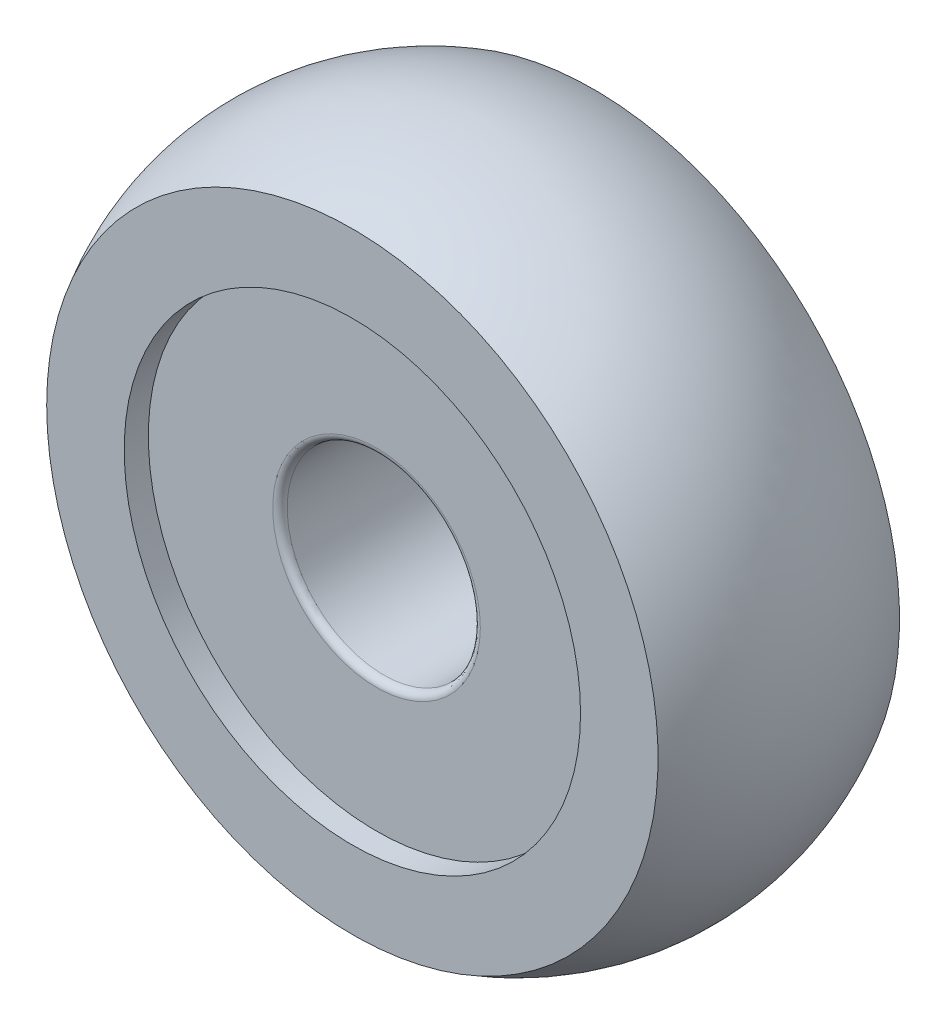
ISO-10303-21;
HEADER;
FILE_DESCRIPTION(('STEP AP214'),'2;1');
FILE_NAME('part.step','',(''),(''),'','','');
FILE_SCHEMA(('AUTOMOTIVE_DESIGN { 1 0 10303 214 1 1 1 1 }'));
ENDSEC;
DATA;
#1=APPLICATION_CONTEXT('core data for automotive mechanical design processes');
#2=APPLICATION_PROTOCOL_DEFINITION('international standard','automotive_design',2000,#1);
#3=PRODUCT_CONTEXT('',#1,'mechanical');
#4=PRODUCT('Part','Part','',(#3));
#5=PRODUCT_RELATED_PRODUCT_CATEGORY('part','',(#4));
#6=PRODUCT_DEFINITION_FORMATION('','',#4);
#7=PRODUCT_DEFINITION_CONTEXT('part definition',#1,'design');
#8=PRODUCT_DEFINITION('design','',#6,#7);
#9=PRODUCT_DEFINITION_SHAPE('','',#8);
#10=(LENGTH_UNIT() NAMED_UNIT(*) SI_UNIT(.MILLI.,.METRE.));
#11=(NAMED_UNIT(*) PLANE_ANGLE_UNIT() SI_UNIT($,.RADIAN.));
#12=(NAMED_UNIT(*) SI_UNIT($,.STERADIAN.) SOLID_ANGLE_UNIT());
#13=UNCERTAINTY_MEASURE_WITH_UNIT(LENGTH_MEASURE(1.E-05),#10,'distance_accuracy_value','');
#14=(GEOMETRIC_REPRESENTATION_CONTEXT(3) GLOBAL_UNCERTAINTY_ASSIGNED_CONTEXT((#13)) GLOBAL_UNIT_ASSIGNED_CONTEXT((#10,
#11,#12)) REPRESENTATION_CONTEXT('',''));
#15=CARTESIAN_POINT('',(0.,0.,0.));
#16=DIRECTION('',(0.,0.,1.));
#17=DIRECTION('',(1.,0.,0.));
#18=AXIS2_PLACEMENT_3D('',#15,#16,#17);
#19=CARTESIAN_POINT('',(0.,6.330127,-2.5));
#20=DIRECTION('',(0.,0.,1.));
#21=DIRECTION('',(1.,0.,0.));
#22=AXIS2_PLACEMENT_3D('',#19,#20,#21);
#23=PLANE('',#22);
#24=CARTESIAN_POINT('',(0.,0.,-2.5));
#25=DIRECTION('',(0.,0.,-1.));
#26=DIRECTION('',(-1.,0.,0.));
#27=AXIS2_PLACEMENT_3D('',#24,#25,#26);
#28=CIRCLE('',#27,6.33012701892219);
#29=CARTESIAN_POINT('',(-6.33012701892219,0.,-2.5));
#30=VERTEX_POINT('',#29);
#31=EDGE_CURVE('E44',#30,#30,#28,.T.);
#32=ORIENTED_EDGE('',*,*,#31,.T.);
#33=EDGE_LOOP('',(#32));
#34=FACE_BOUND('',#33,.T.);
#35=CARTESIAN_POINT('',(0.,0.,-2.5));
#36=DIRECTION('',(0.,0.,1.));
#37=DIRECTION('',(1.,0.,0.));
#38=AXIS2_PLACEMENT_3D('',#35,#36,#37);
#39=CIRCLE('',#38,4.725);
#40=CARTESIAN_POINT('',(4.725,0.,-2.5));
#41=VERTEX_POINT('',#40);
#42=EDGE_CURVE('E32',#41,#41,#39,.T.);
#43=ORIENTED_EDGE('',*,*,#42,.T.);
#44=EDGE_LOOP('',(#43));
#45=FACE_BOUND('',#44,.T.);
#46=ADVANCED_FACE('F12',(#34,#45),#23,.F.);
#47=CARTESIAN_POINT('',(0.,6.330127,2.5));
#48=DIRECTION('',(0.,0.,-1.));
#49=DIRECTION('',(-1.,0.,0.));
#50=AXIS2_PLACEMENT_3D('',#47,#48,#49);
#51=PLANE('',#50);
#52=CARTESIAN_POINT('',(0.,0.,2.5));
#53=DIRECTION('',(0.,0.,-1.));
#54=DIRECTION('',(-1.,0.,0.));
#55=AXIS2_PLACEMENT_3D('',#52,#53,#54);
#56=CIRCLE('',#55,6.33012701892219);
#57=CARTESIAN_POINT('',(-6.33012701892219,0.,2.5));
#58=VERTEX_POINT('',#57);
#59=EDGE_CURVE('E47',#58,#58,#56,.T.);
#60=ORIENTED_EDGE('',*,*,#59,.F.);
#61=EDGE_LOOP('',(#60));
#62=FACE_BOUND('',#61,.T.);
#63=CARTESIAN_POINT('',(0.,0.,2.5));
#64=DIRECTION('',(0.,0.,1.));
#65=DIRECTION('',(1.,0.,0.));
#66=AXIS2_PLACEMENT_3D('',#63,#64,#65);
#67=CIRCLE('',#66,4.725);
#68=CARTESIAN_POINT('',(4.725,0.,2.5));
#69=VERTEX_POINT('',#68);
#70=EDGE_CURVE('E35',#69,#69,#67,.T.);
#71=ORIENTED_EDGE('',*,*,#70,.F.);
#72=EDGE_LOOP('',(#71));
#73=FACE_BOUND('',#72,.T.);
#74=ADVANCED_FACE('F54',(#62,#73),#51,.F.);
#75=CARTESIAN_POINT('',(0.,0.,1.85));
#76=DIRECTION('',(0.,0.,1.));
#77=DIRECTION('',(1.,0.,0.));
#78=AXIS2_PLACEMENT_3D('',#75,#76,#77);
#79=TOROIDAL_SURFACE('',#78,2.15,0.149999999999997);
#80=CARTESIAN_POINT('',(0.,0.,1.85));
#81=DIRECTION('',(0.,0.,1.));
#82=DIRECTION('',(1.,0.,0.));
#83=AXIS2_PLACEMENT_3D('',#80,#81,#82);
#84=CIRCLE('',#83,2.);
#85=CARTESIAN_POINT('',(2.,0.,1.85));
#86=VERTEX_POINT('',#85);
#87=EDGE_CURVE('E8',#86,#86,#84,.T.);
#88=ORIENTED_EDGE('',*,*,#87,.F.);
#89=EDGE_LOOP('',(#88));
#90=FACE_BOUND('',#89,.T.);
#91=CARTESIAN_POINT('',(0.,0.,2.));
#92=DIRECTION('',(0.,0.,1.));
#93=DIRECTION('',(1.,0.,0.));
#94=AXIS2_PLACEMENT_3D('',#91,#92,#93);
#95=CIRCLE('',#94,2.15);
#96=CARTESIAN_POINT('',(2.15,0.,2.));
#97=VERTEX_POINT('',#96);
#98=EDGE_CURVE('E41',#97,#97,#95,.T.);
#99=ORIENTED_EDGE('',*,*,#98,.T.);
#100=EDGE_LOOP('',(#99));
#101=FACE_BOUND('',#100,.T.);
#102=ADVANCED_FACE('F14',(#90,#101),#79,.T.);
#103=CARTESIAN_POINT('',(0.,0.,5.5));
#104=DIRECTION('',(0.,0.,1.));
#105=DIRECTION('',(1.,0.,0.));
#106=AXIS2_PLACEMENT_3D('',#103,#104,#105);
#107=CYLINDRICAL_SURFACE('',#106,2.);
#108=CARTESIAN_POINT('',(0.,0.,-1.85));
#109=DIRECTION('',(0.,0.,1.));
#110=DIRECTION('',(1.,0.,0.));
#111=AXIS2_PLACEMENT_3D('',#108,#109,#110);
#112=CIRCLE('',#111,2.);
#113=CARTESIAN_POINT('',(2.,0.,-1.85));
#114=VERTEX_POINT('',#113);
#115=EDGE_CURVE('E19',#114,#114,#112,.T.);
#116=ORIENTED_EDGE('',*,*,#115,.F.);
#117=EDGE_LOOP('',(#116));
#118=FACE_BOUND('',#117,.T.);
#119=ORIENTED_EDGE('',*,*,#87,.T.);
#120=EDGE_LOOP('',(#119));
#121=FACE_BOUND('',#120,.T.);
#122=ADVANCED_FACE('F89',(#118,#121),#107,.F.);
#123=CARTESIAN_POINT('',(0.,0.,-1.85));
#124=DIRECTION('',(0.,0.,1.));
#125=DIRECTION('',(1.,0.,0.));
#126=AXIS2_PLACEMENT_3D('',#123,#124,#125);
#127=TOROIDAL_SURFACE('',#126,2.15,0.149999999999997);
#128=CARTESIAN_POINT('',(0.,0.,-2.));
#129=DIRECTION('',(0.,0.,1.));
#130=DIRECTION('',(1.,0.,0.));
#131=AXIS2_PLACEMENT_3D('',#128,#129,#130);
#132=CIRCLE('',#131,2.15);
#133=CARTESIAN_POINT('',(2.15,0.,-2.));
#134=VERTEX_POINT('',#133);
#135=EDGE_CURVE('E23',#134,#134,#132,.T.);
#136=ORIENTED_EDGE('',*,*,#135,.F.);
#137=EDGE_LOOP('',(#136));
#138=FACE_BOUND('',#137,.T.);
#139=ORIENTED_EDGE('',*,*,#115,.T.);
#140=EDGE_LOOP('',(#139));
#141=FACE_BOUND('',#140,.T.);
#142=ADVANCED_FACE('F86',(#138,#141),#127,.T.);
#143=CARTESIAN_POINT('',(0.,2.15,-2.));
#144=DIRECTION('',(0.,0.,1.));
#145=DIRECTION('',(1.,0.,0.));
#146=AXIS2_PLACEMENT_3D('',#143,#144,#145);
#147=PLANE('',#146);
#148=CARTESIAN_POINT('',(0.,0.,-2.));
#149=DIRECTION('',(0.,0.,1.));
#150=DIRECTION('',(1.,0.,0.));
#151=AXIS2_PLACEMENT_3D('',#148,#149,#150);
#152=CIRCLE('',#151,4.725);
#153=CARTESIAN_POINT('',(4.725,0.,-2.));
#154=VERTEX_POINT('',#153);
#155=EDGE_CURVE('E27',#154,#154,#152,.T.);
#156=ORIENTED_EDGE('',*,*,#155,.F.);
#157=EDGE_LOOP('',(#156));
#158=FACE_BOUND('',#157,.T.);
#159=ORIENTED_EDGE('',*,*,#135,.T.);
#160=EDGE_LOOP('',(#159));
#161=FACE_BOUND('',#160,.T.);
#162=ADVANCED_FACE('F73',(#158,#161),#147,.F.);
#163=CARTESIAN_POINT('',(0.,0.,5.5));
#164=DIRECTION('',(0.,0.,1.));
#165=DIRECTION('',(1.,0.,0.));
#166=AXIS2_PLACEMENT_3D('',#163,#164,#165);
#167=CYLINDRICAL_SURFACE('',#166,4.725);
#168=ORIENTED_EDGE('',*,*,#42,.F.);
#169=EDGE_LOOP('',(#168));
#170=FACE_BOUND('',#169,.T.);
#171=ORIENTED_EDGE('',*,*,#155,.T.);
#172=EDGE_LOOP('',(#171));
#173=FACE_BOUND('',#172,.T.);
#174=ADVANCED_FACE('F63',(#170,#173),#167,.F.);
#175=CARTESIAN_POINT('',(0.,0.,5.5));
#176=DIRECTION('',(0.,0.,1.));
#177=DIRECTION('',(1.,0.,0.));
#178=AXIS2_PLACEMENT_3D('',#175,#176,#177);
#179=CYLINDRICAL_SURFACE('',#178,4.725);
#180=CARTESIAN_POINT('',(0.,0.,2.));
#181=DIRECTION('',(0.,0.,1.));
#182=DIRECTION('',(1.,0.,0.));
#183=AXIS2_PLACEMENT_3D('',#180,#181,#182);
#184=CIRCLE('',#183,4.725);
#185=CARTESIAN_POINT('',(4.725,0.,2.));
#186=VERTEX_POINT('',#185);
#187=EDGE_CURVE('E38',#186,#186,#184,.T.);
#188=ORIENTED_EDGE('',*,*,#187,.F.);
#189=EDGE_LOOP('',(#188));
#190=FACE_BOUND('',#189,.T.);
#191=ORIENTED_EDGE('',*,*,#70,.T.);
#192=EDGE_LOOP('',(#191));
#193=FACE_BOUND('',#192,.T.);
#194=ADVANCED_FACE('F60',(#190,#193),#179,.F.);
#195=CARTESIAN_POINT('',(0.,4.725,2.));
#196=DIRECTION('',(0.,0.,-1.));
#197=DIRECTION('',(-1.,0.,0.));
#198=AXIS2_PLACEMENT_3D('',#195,#196,#197);
#199=PLANE('',#198);
#200=ORIENTED_EDGE('',*,*,#98,.F.);
#201=EDGE_LOOP('',(#200));
#202=FACE_BOUND('',#201,.T.);
#203=ORIENTED_EDGE('',*,*,#187,.T.);
#204=EDGE_LOOP('',(#203));
#205=FACE_BOUND('',#204,.T.);
#206=ADVANCED_FACE('F62',(#202,#205),#199,.F.);
#207=CARTESIAN_POINT('',(0.,0.,0.));
#208=DIRECTION('',(0.,0.,-1.));
#209=DIRECTION('',(-1.,0.,0.));
#210=AXIS2_PLACEMENT_3D('',#207,#208,#209);
#211=DEGENERATE_TOROIDAL_SURFACE('',#210,2.,5.,.T.);
#212=ORIENTED_EDGE('',*,*,#59,.T.);
#213=EDGE_LOOP('',(#212));
#214=FACE_BOUND('',#213,.T.);
#215=ORIENTED_EDGE('',*,*,#31,.F.);
#216=EDGE_LOOP('',(#215));
#217=FACE_BOUND('',#216,.T.);
#218=ADVANCED_FACE('F51',(#214,#217),#211,.T.);
#219=CLOSED_SHELL('',(#46,#74,#102,#122,#142,#162,#174,#194,#206,#218));
#220=MANIFOLD_SOLID_BREP('B1',#219);
#221=ADVANCED_BREP_SHAPE_REPRESENTATION('',(#18,#220),#14);
#222=SHAPE_DEFINITION_REPRESENTATION(#9,#221);
ENDSEC;
END-ISO-10303-21;
